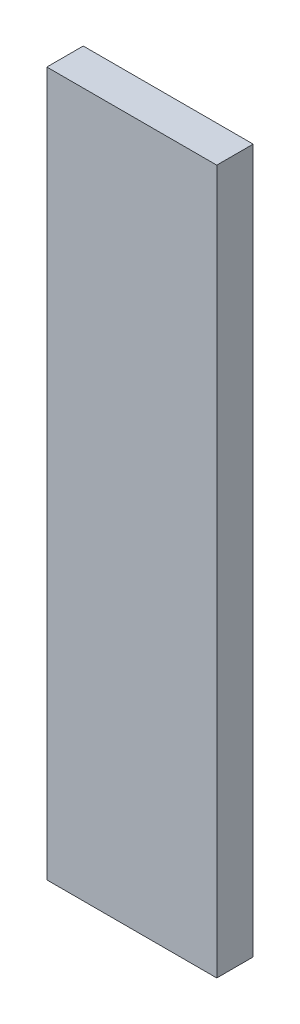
ISO-10303-21;
HEADER;
FILE_DESCRIPTION(('STEP AP214'),'2;1');
FILE_NAME('part.step','',(''),(''),'','','');
FILE_SCHEMA(('AUTOMOTIVE_DESIGN { 1 0 10303 214 1 1 1 1 }'));
ENDSEC;
DATA;
#1=APPLICATION_CONTEXT('core data for automotive mechanical design processes');
#2=APPLICATION_PROTOCOL_DEFINITION('international standard','automotive_design',2000,#1);
#3=PRODUCT_CONTEXT('',#1,'mechanical');
#4=PRODUCT('Part','Part','',(#3));
#5=PRODUCT_RELATED_PRODUCT_CATEGORY('part','',(#4));
#6=PRODUCT_DEFINITION_FORMATION('','',#4);
#7=PRODUCT_DEFINITION_CONTEXT('part definition',#1,'design');
#8=PRODUCT_DEFINITION('design','',#6,#7);
#9=PRODUCT_DEFINITION_SHAPE('','',#8);
#10=(LENGTH_UNIT() NAMED_UNIT(*) SI_UNIT(.MILLI.,.METRE.));
#11=(NAMED_UNIT(*) PLANE_ANGLE_UNIT() SI_UNIT($,.RADIAN.));
#12=(NAMED_UNIT(*) SI_UNIT($,.STERADIAN.) SOLID_ANGLE_UNIT());
#13=UNCERTAINTY_MEASURE_WITH_UNIT(LENGTH_MEASURE(1.E-05),#10,'distance_accuracy_value','');
#14=(GEOMETRIC_REPRESENTATION_CONTEXT(3) GLOBAL_UNCERTAINTY_ASSIGNED_CONTEXT((#13)) GLOBAL_UNIT_ASSIGNED_CONTEXT((#10,
#11,#12)) REPRESENTATION_CONTEXT('',''));
#15=CARTESIAN_POINT('',(0.,0.,0.));
#16=DIRECTION('',(0.,0.,1.));
#17=DIRECTION('',(1.,0.,0.));
#18=AXIS2_PLACEMENT_3D('',#15,#16,#17);
#19=CARTESIAN_POINT('',(-0.1778,-0.7366,0.));
#20=DIRECTION('',(0.,0.,1.));
#21=DIRECTION('',(1.,0.,0.));
#22=AXIS2_PLACEMENT_3D('',#19,#20,#21);
#23=PLANE('',#22);
#24=DIRECTION('',(-1.,0.,0.));
#25=VECTOR('',#24,1.);
#26=CARTESIAN_POINT('',(0.,0.7366,0.));
#27=LINE('',#26,#25);
#28=CARTESIAN_POINT('',(0.1778,0.7366,0.));
#29=VERTEX_POINT('',#28);
#30=CARTESIAN_POINT('',(-0.1778,0.7366,0.));
#31=VERTEX_POINT('',#30);
#32=EDGE_CURVE('E56',#29,#31,#27,.T.);
#33=ORIENTED_EDGE('',*,*,#32,.F.);
#34=DIRECTION('',(0.,1.,0.));
#35=VECTOR('',#34,1.);
#36=CARTESIAN_POINT('',(0.1778,0.,0.));
#37=LINE('',#36,#35);
#38=CARTESIAN_POINT('',(0.1778,-0.7366,0.));
#39=VERTEX_POINT('',#38);
#40=EDGE_CURVE('E58',#39,#29,#37,.T.);
#41=ORIENTED_EDGE('',*,*,#40,.F.);
#42=DIRECTION('',(1.,0.,0.));
#43=VECTOR('',#42,1.);
#44=CARTESIAN_POINT('',(0.,-0.7366,0.));
#45=LINE('',#44,#43);
#46=CARTESIAN_POINT('',(-0.1778,-0.7366,0.));
#47=VERTEX_POINT('',#46);
#48=EDGE_CURVE('E21',#47,#39,#45,.T.);
#49=ORIENTED_EDGE('',*,*,#48,.F.);
#50=DIRECTION('',(0.,-1.,0.));
#51=VECTOR('',#50,1.);
#52=CARTESIAN_POINT('',(-0.1778,0.,0.));
#53=LINE('',#52,#51);
#54=EDGE_CURVE('E81',#31,#47,#53,.T.);
#55=ORIENTED_EDGE('',*,*,#54,.F.);
#56=EDGE_LOOP('',(#33,#41,#49,#55));
#57=FACE_BOUND('',#56,.T.);
#58=ADVANCED_FACE('F17',(#57),#23,.F.);
#59=CARTESIAN_POINT('',(-0.1778,-0.7366,0.0762));
#60=DIRECTION('',(0.,-1.,0.));
#61=DIRECTION('',(0.,0.,-1.));
#62=AXIS2_PLACEMENT_3D('',#59,#60,#61);
#63=PLANE('',#62);
#64=DIRECTION('',(0.,0.,1.));
#65=VECTOR('',#64,1.);
#66=CARTESIAN_POINT('',(-0.1778,-0.7366,0.0381));
#67=LINE('',#66,#65);
#68=CARTESIAN_POINT('',(-0.1778,-0.7366,0.0762));
#69=VERTEX_POINT('',#68);
#70=EDGE_CURVE('E69',#47,#69,#67,.T.);
#71=ORIENTED_EDGE('',*,*,#70,.F.);
#72=ORIENTED_EDGE('',*,*,#48,.T.);
#73=DIRECTION('',(0.,0.,-1.));
#74=VECTOR('',#73,1.);
#75=CARTESIAN_POINT('',(0.1778,-0.7366,0.0381));
#76=LINE('',#75,#74);
#77=CARTESIAN_POINT('',(0.1778,-0.7366,0.0762));
#78=VERTEX_POINT('',#77);
#79=EDGE_CURVE('E64',#78,#39,#76,.T.);
#80=ORIENTED_EDGE('',*,*,#79,.F.);
#81=DIRECTION('',(1.,0.,0.));
#82=VECTOR('',#81,1.);
#83=CARTESIAN_POINT('',(0.,-0.7366,0.0762));
#84=LINE('',#83,#82);
#85=EDGE_CURVE('E84',#69,#78,#84,.T.);
#86=ORIENTED_EDGE('',*,*,#85,.F.);
#87=EDGE_LOOP('',(#71,#72,#80,#86));
#88=FACE_BOUND('',#87,.T.);
#89=ADVANCED_FACE('F66',(#88),#63,.T.);
#90=CARTESIAN_POINT('',(0.1778,-0.7366,0.0762));
#91=DIRECTION('',(1.,0.,0.));
#92=DIRECTION('',(0.,0.,-1.));
#93=AXIS2_PLACEMENT_3D('',#90,#91,#92);
#94=PLANE('',#93);
#95=ORIENTED_EDGE('',*,*,#79,.T.);
#96=ORIENTED_EDGE('',*,*,#40,.T.);
#97=DIRECTION('',(0.,0.,-1.));
#98=VECTOR('',#97,1.);
#99=CARTESIAN_POINT('',(0.1778,0.7366,0.0381));
#100=LINE('',#99,#98);
#101=CARTESIAN_POINT('',(0.1778,0.7366,0.0762));
#102=VERTEX_POINT('',#101);
#103=EDGE_CURVE('E76',#102,#29,#100,.T.);
#104=ORIENTED_EDGE('',*,*,#103,.F.);
#105=DIRECTION('',(0.,1.,0.));
#106=VECTOR('',#105,1.);
#107=CARTESIAN_POINT('',(0.1778,0.,0.0762));
#108=LINE('',#107,#106);
#109=EDGE_CURVE('E73',#78,#102,#108,.T.);
#110=ORIENTED_EDGE('',*,*,#109,.F.);
#111=EDGE_LOOP('',(#95,#96,#104,#110));
#112=FACE_BOUND('',#111,.T.);
#113=ADVANCED_FACE('F71',(#112),#94,.T.);
#114=CARTESIAN_POINT('',(0.1778,0.7366,0.0762));
#115=DIRECTION('',(0.,1.,0.));
#116=DIRECTION('',(0.,0.,-1.));
#117=AXIS2_PLACEMENT_3D('',#114,#115,#116);
#118=PLANE('',#117);
#119=ORIENTED_EDGE('',*,*,#103,.T.);
#120=ORIENTED_EDGE('',*,*,#32,.T.);
#121=DIRECTION('',(0.,0.,-1.));
#122=VECTOR('',#121,1.);
#123=CARTESIAN_POINT('',(-0.1778,0.7366,0.0381));
#124=LINE('',#123,#122);
#125=CARTESIAN_POINT('',(-0.1778,0.7366,0.0762));
#126=VERTEX_POINT('',#125);
#127=EDGE_CURVE('E36',#126,#31,#124,.T.);
#128=ORIENTED_EDGE('',*,*,#127,.F.);
#129=DIRECTION('',(-1.,0.,0.));
#130=VECTOR('',#129,1.);
#131=CARTESIAN_POINT('',(0.,0.7366,0.0762));
#132=LINE('',#131,#130);
#133=EDGE_CURVE('E27',#102,#126,#132,.T.);
#134=ORIENTED_EDGE('',*,*,#133,.F.);
#135=EDGE_LOOP('',(#119,#120,#128,#134));
#136=FACE_BOUND('',#135,.T.);
#137=ADVANCED_FACE('F89',(#136),#118,.T.);
#138=CARTESIAN_POINT('',(-0.1778,0.7366,0.0762));
#139=DIRECTION('',(-1.,0.,0.));
#140=DIRECTION('',(0.,0.,-1.));
#141=AXIS2_PLACEMENT_3D('',#138,#139,#140);
#142=PLANE('',#141);
#143=ORIENTED_EDGE('',*,*,#127,.T.);
#144=ORIENTED_EDGE('',*,*,#54,.T.);
#145=ORIENTED_EDGE('',*,*,#70,.T.);
#146=DIRECTION('',(0.,-1.,0.));
#147=VECTOR('',#146,1.);
#148=CARTESIAN_POINT('',(-0.1778,0.,0.0762));
#149=LINE('',#148,#147);
#150=EDGE_CURVE('E11',#126,#69,#149,.T.);
#151=ORIENTED_EDGE('',*,*,#150,.F.);
#152=EDGE_LOOP('',(#143,#144,#145,#151));
#153=FACE_BOUND('',#152,.T.);
#154=ADVANCED_FACE('F91',(#153),#142,.T.);
#155=CARTESIAN_POINT('',(-0.1778,-0.7366,0.0762));
#156=DIRECTION('',(0.,0.,1.));
#157=DIRECTION('',(1.,0.,0.));
#158=AXIS2_PLACEMENT_3D('',#155,#156,#157);
#159=PLANE('',#158);
#160=ORIENTED_EDGE('',*,*,#133,.T.);
#161=ORIENTED_EDGE('',*,*,#150,.T.);
#162=ORIENTED_EDGE('',*,*,#85,.T.);
#163=ORIENTED_EDGE('',*,*,#109,.T.);
#164=EDGE_LOOP('',(#160,#161,#162,#163));
#165=FACE_BOUND('',#164,.T.);
#166=ADVANCED_FACE('F19',(#165),#159,.T.);
#167=CLOSED_SHELL('',(#58,#89,#113,#137,#154,#166));
#168=MANIFOLD_SOLID_BREP('B1',#167);
#169=ADVANCED_BREP_SHAPE_REPRESENTATION('',(#18,#168),#14);
#170=SHAPE_DEFINITION_REPRESENTATION(#9,#169);
ENDSEC;
END-ISO-10303-21;
